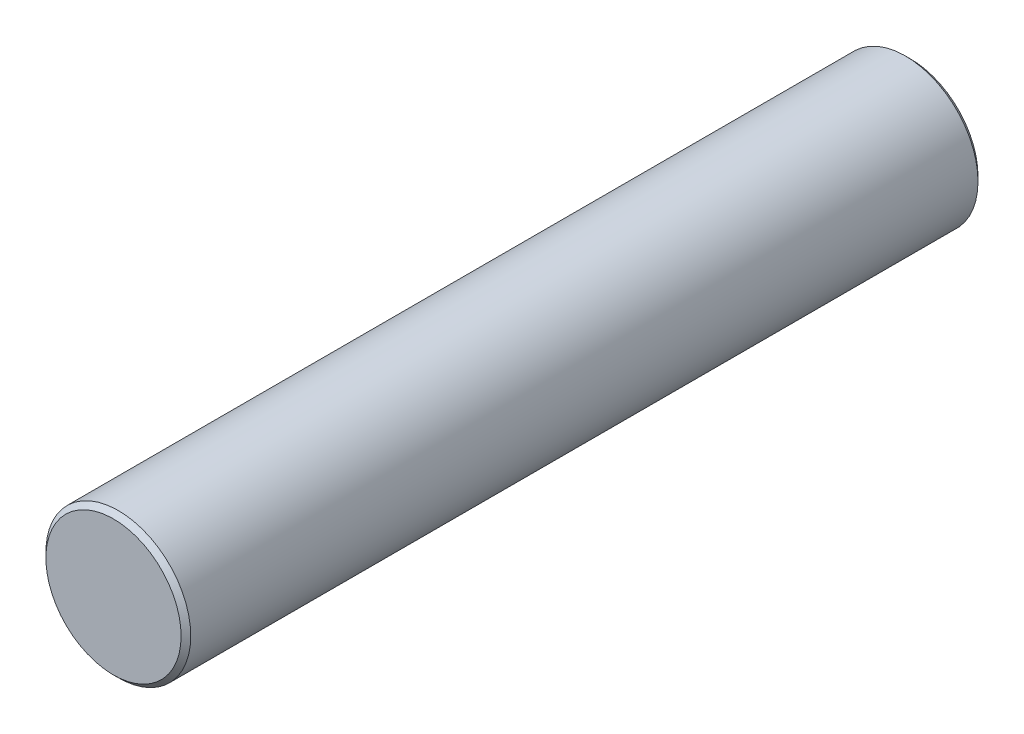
ISO-10303-21;
HEADER;
FILE_DESCRIPTION(('STEP AP214'),'2;1');
FILE_NAME('part.step','',(''),(''),'','','');
FILE_SCHEMA(('AUTOMOTIVE_DESIGN { 1 0 10303 214 1 1 1 1 }'));
ENDSEC;
DATA;
#1=APPLICATION_CONTEXT('core data for automotive mechanical design processes');
#2=APPLICATION_PROTOCOL_DEFINITION('international standard','automotive_design',2000,#1);
#3=PRODUCT_CONTEXT('',#1,'mechanical');
#4=PRODUCT('Part','Part','',(#3));
#5=PRODUCT_RELATED_PRODUCT_CATEGORY('part','',(#4));
#6=PRODUCT_DEFINITION_FORMATION('','',#4);
#7=PRODUCT_DEFINITION_CONTEXT('part definition',#1,'design');
#8=PRODUCT_DEFINITION('design','',#6,#7);
#9=PRODUCT_DEFINITION_SHAPE('','',#8);
#10=(LENGTH_UNIT() NAMED_UNIT(*) SI_UNIT(.MILLI.,.METRE.));
#11=(NAMED_UNIT(*) PLANE_ANGLE_UNIT() SI_UNIT($,.RADIAN.));
#12=(NAMED_UNIT(*) SI_UNIT($,.STERADIAN.) SOLID_ANGLE_UNIT());
#13=UNCERTAINTY_MEASURE_WITH_UNIT(LENGTH_MEASURE(1.E-05),#10,'distance_accuracy_value','');
#14=(GEOMETRIC_REPRESENTATION_CONTEXT(3) GLOBAL_UNCERTAINTY_ASSIGNED_CONTEXT((#13)) GLOBAL_UNIT_ASSIGNED_CONTEXT((#10,
#11,#12)) REPRESENTATION_CONTEXT('',''));
#15=CARTESIAN_POINT('',(0.,0.,0.));
#16=DIRECTION('',(0.,0.,1.));
#17=DIRECTION('',(1.,0.,0.));
#18=AXIS2_PLACEMENT_3D('',#15,#16,#17);
#19=CARTESIAN_POINT('',(0.,0.,8.25));
#20=DIRECTION('',(0.,0.,-1.));
#21=DIRECTION('',(-1.,0.,0.));
#22=AXIS2_PLACEMENT_3D('',#19,#20,#21);
#23=CYLINDRICAL_SURFACE('',#22,1.5);
#24=CARTESIAN_POINT('',(0.,0.,-8.15));
#25=DIRECTION('',(0.,0.,1.));
#26=DIRECTION('',(1.,0.,0.));
#27=AXIS2_PLACEMENT_3D('',#24,#25,#26);
#28=CIRCLE('',#27,1.5);
#29=CARTESIAN_POINT('',(1.5,0.,-8.15));
#30=VERTEX_POINT('',#29);
#31=EDGE_CURVE('E50',#30,#30,#28,.T.);
#32=ORIENTED_EDGE('',*,*,#31,.T.);
#33=EDGE_LOOP('',(#32));
#34=FACE_BOUND('',#33,.T.);
#35=CARTESIAN_POINT('',(0.,0.,8.15));
#36=DIRECTION('',(0.,0.,1.));
#37=DIRECTION('',(1.,0.,0.));
#38=AXIS2_PLACEMENT_3D('',#35,#36,#37);
#39=CIRCLE('',#38,1.5);
#40=CARTESIAN_POINT('',(1.5,0.,8.15));
#41=VERTEX_POINT('',#40);
#42=EDGE_CURVE('E54',#41,#41,#39,.F.);
#43=ORIENTED_EDGE('',*,*,#42,.T.);
#44=EDGE_LOOP('',(#43));
#45=FACE_BOUND('',#44,.T.);
#46=ADVANCED_FACE('F39',(#34,#45),#23,.T.);
#47=CARTESIAN_POINT('',(0.,0.,8.25));
#48=DIRECTION('',(0.,0.,1.));
#49=DIRECTION('',(1.,0.,0.));
#50=AXIS2_PLACEMENT_3D('',#47,#48,#49);
#51=PLANE('',#50);
#52=CARTESIAN_POINT('',(0.,0.,8.25));
#53=DIRECTION('',(0.,0.,1.));
#54=DIRECTION('',(1.,0.,0.));
#55=AXIS2_PLACEMENT_3D('',#52,#53,#54);
#56=CIRCLE('',#55,1.4);
#57=CARTESIAN_POINT('',(1.4,0.,8.25));
#58=VERTEX_POINT('',#57);
#59=EDGE_CURVE('E10',#58,#58,#56,.T.);
#60=ORIENTED_EDGE('',*,*,#59,.T.);
#61=EDGE_LOOP('',(#60));
#62=FACE_BOUND('',#61,.T.);
#63=ADVANCED_FACE('F70',(#62),#51,.T.);
#64=CARTESIAN_POINT('',(0.,0.,-8.25));
#65=DIRECTION('',(0.,0.,1.));
#66=DIRECTION('',(1.,0.,0.));
#67=AXIS2_PLACEMENT_3D('',#64,#65,#66);
#68=PLANE('',#67);
#69=CARTESIAN_POINT('',(0.,0.,-8.25));
#70=DIRECTION('',(0.,0.,1.));
#71=DIRECTION('',(1.,0.,0.));
#72=AXIS2_PLACEMENT_3D('',#69,#70,#71);
#73=CIRCLE('',#72,1.4);
#74=CARTESIAN_POINT('',(1.4,0.,-8.25));
#75=VERTEX_POINT('',#74);
#76=EDGE_CURVE('E46',#75,#75,#73,.F.);
#77=ORIENTED_EDGE('',*,*,#76,.T.);
#78=EDGE_LOOP('',(#77));
#79=FACE_BOUND('',#78,.T.);
#80=ADVANCED_FACE('F67',(#79),#68,.F.);
#81=CARTESIAN_POINT('',(0.,0.,-8.15));
#82=DIRECTION('',(0.,0.,1.));
#83=DIRECTION('',(1.,0.,0.));
#84=AXIS2_PLACEMENT_3D('',#81,#82,#83);
#85=CONICAL_SURFACE('',#84,1.5,0.785398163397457);
#86=ORIENTED_EDGE('',*,*,#76,.F.);
#87=EDGE_LOOP('',(#86));
#88=FACE_BOUND('',#87,.T.);
#89=ORIENTED_EDGE('',*,*,#31,.F.);
#90=EDGE_LOOP('',(#89));
#91=FACE_BOUND('',#90,.T.);
#92=ADVANCED_FACE('F63',(#88,#91),#85,.T.);
#93=CARTESIAN_POINT('',(0.,0.,8.25));
#94=DIRECTION('',(0.,0.,-1.));
#95=DIRECTION('',(-1.,0.,0.));
#96=AXIS2_PLACEMENT_3D('',#93,#94,#95);
#97=CONICAL_SURFACE('',#96,1.4,0.78539816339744);
#98=ORIENTED_EDGE('',*,*,#42,.F.);
#99=EDGE_LOOP('',(#98));
#100=FACE_BOUND('',#99,.T.);
#101=ORIENTED_EDGE('',*,*,#59,.F.);
#102=EDGE_LOOP('',(#101));
#103=FACE_BOUND('',#102,.T.);
#104=ADVANCED_FACE('F41',(#100,#103),#97,.T.);
#105=CLOSED_SHELL('',(#46,#63,#80,#92,#104));
#106=MANIFOLD_SOLID_BREP('B2',#105);
#107=ADVANCED_BREP_SHAPE_REPRESENTATION('',(#18,#106),#14);
#108=SHAPE_DEFINITION_REPRESENTATION(#9,#107);
ENDSEC;
END-ISO-10303-21;
